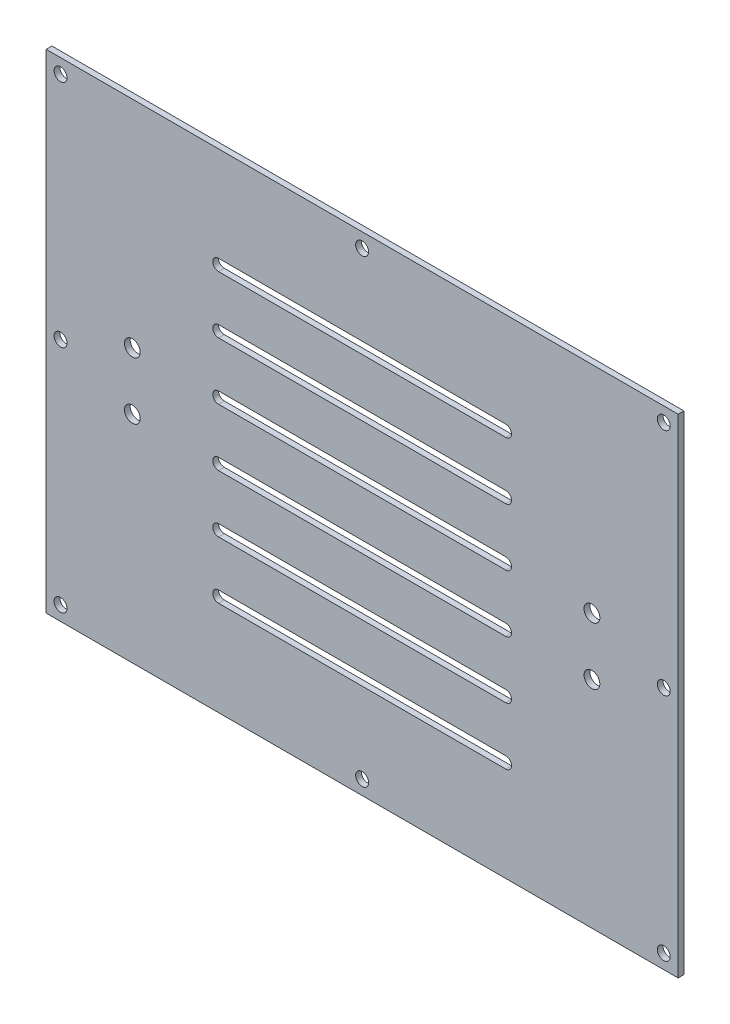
from build123d import *

# Parameters (mm, degrees)
SKETCH_1_W             = 220
SKETCH_1_H             = 170
EXTRUDE_1_DEPTH        = 2
CUT_EXTRUDE_1_REACH    = 280.036
SKETCH_3_R             = 2.25
CUT_EXTRUDE_2_DEPTH    = 2
PATTERN_LINEAR_1_COUNT = 6
PATTERN_LINEAR_1_PITCH = 20
CUT_EXTRUDE_3_REACH    = 280.036
SKETCH_4_R             = 2.75


with BuildPart() as part:
    # Sketch 1 → Extrude 1 (new body)
    with BuildSketch(Plane.XY):
        with Locations((110, -85)):
            Rectangle(SKETCH_1_W, SKETCH_1_H)
    extrude(amount=EXTRUDE_1_DEPTH)

    # Sketch 2 → Cut-Extrude 1 (cut, up to next)
    with BuildSketch(Plane.XY.offset(2), mode=Mode.PRIVATE) as cut_extrude_1_sk1:
        with BuildLine():
            Line((60, -33), (160, -33))
            ThreePointArc((160, -33), (162, -35), (160, -37))
            Line((160, -37), (60, -37))
            ThreePointArc((60, -37), (58, -35), (60, -33))
        make_face()
    cut_extrude_1_tool1 = extrude(cut_extrude_1_sk1.sketch, amount=-CUT_EXTRUDE_1_REACH, mode=Mode.PRIVATE) & part.part
    cut_extrude_1 = cut_extrude_1_tool1.solids().sort_by_distance((110, -35, 2))[0]
    add(cut_extrude_1, mode=Mode.SUBTRACT)

    # Sketch 3 → Cut-Extrude 2 (cut)
    with BuildSketch(Plane.XY.offset(2)):
        with Locations((5, -5)):
            Circle(SKETCH_3_R)
        with Locations((215, -5)):
            Circle(SKETCH_3_R)
        with Locations((5, -165)):
            Circle(SKETCH_3_R)
        with Locations((215, -165)):
            Circle(SKETCH_3_R)
        with Locations((5, -85)):
            Circle(SKETCH_3_R)
        with Locations((215, -85)):
            Circle(SKETCH_3_R)
        with Locations((110, -5)):
            Circle(SKETCH_3_R)
        with Locations((110, -165)):
            Circle(SKETCH_3_R)
    extrude(amount=-CUT_EXTRUDE_2_DEPTH, mode=Mode.SUBTRACT)

    # Pattern Linear 1: Cut-Extrude 1 ×6
    with Locations(*[(0, -i * PATTERN_LINEAR_1_PITCH, 0) for i in range(1, PATTERN_LINEAR_1_COUNT)]):
        add(cut_extrude_1, mode=Mode.SUBTRACT)

    # Sketch 4 → Cut-Extrude 3 (cut, up to next)
    with BuildSketch(Plane.XY.offset(2), mode=Mode.PRIVATE) as cut_extrude_3_sk1:
        with Locations((30, -75)):
            Circle(SKETCH_4_R)
    cut_extrude_3_tool1 = extrude(cut_extrude_3_sk1.sketch, amount=-CUT_EXTRUDE_3_REACH, mode=Mode.PRIVATE) & part.part
    # Sketch 4 → Cut-Extrude 3 (cut, up to next)
    with BuildSketch(Plane.XY.offset(2), mode=Mode.PRIVATE) as cut_extrude_3_sk2:
        with Locations((30, -95)):
            Circle(SKETCH_4_R)
    cut_extrude_3_tool2 = extrude(cut_extrude_3_sk2.sketch, amount=-CUT_EXTRUDE_3_REACH, mode=Mode.PRIVATE) & part.part
    # Sketch 4 → Cut-Extrude 3 (cut, up to next)
    with BuildSketch(Plane.XY.offset(2), mode=Mode.PRIVATE) as cut_extrude_3_sk3:
        with Locations((190, -75)):
            Circle(SKETCH_4_R)
    cut_extrude_3_tool3 = extrude(cut_extrude_3_sk3.sketch, amount=-CUT_EXTRUDE_3_REACH, mode=Mode.PRIVATE) & part.part
    # Sketch 4 → Cut-Extrude 3 (cut, up to next)
    with BuildSketch(Plane.XY.offset(2), mode=Mode.PRIVATE) as cut_extrude_3_sk4:
        with Locations((190, -95)):
            Circle(SKETCH_4_R)
    cut_extrude_3_tool4 = extrude(cut_extrude_3_sk4.sketch, amount=-CUT_EXTRUDE_3_REACH, mode=Mode.PRIVATE) & part.part
    add(cut_extrude_3_tool1.solids().sort_by_distance((30, -75, 2))[0], mode=Mode.SUBTRACT)
    add(cut_extrude_3_tool2.solids().sort_by_distance((30, -95, 2))[0], mode=Mode.SUBTRACT)
    add(cut_extrude_3_tool3.solids().sort_by_distance((190, -75, 2))[0], mode=Mode.SUBTRACT)
    add(cut_extrude_3_tool4.solids().sort_by_distance((190, -95, 2))[0], mode=Mode.SUBTRACT)


solid = part.part
